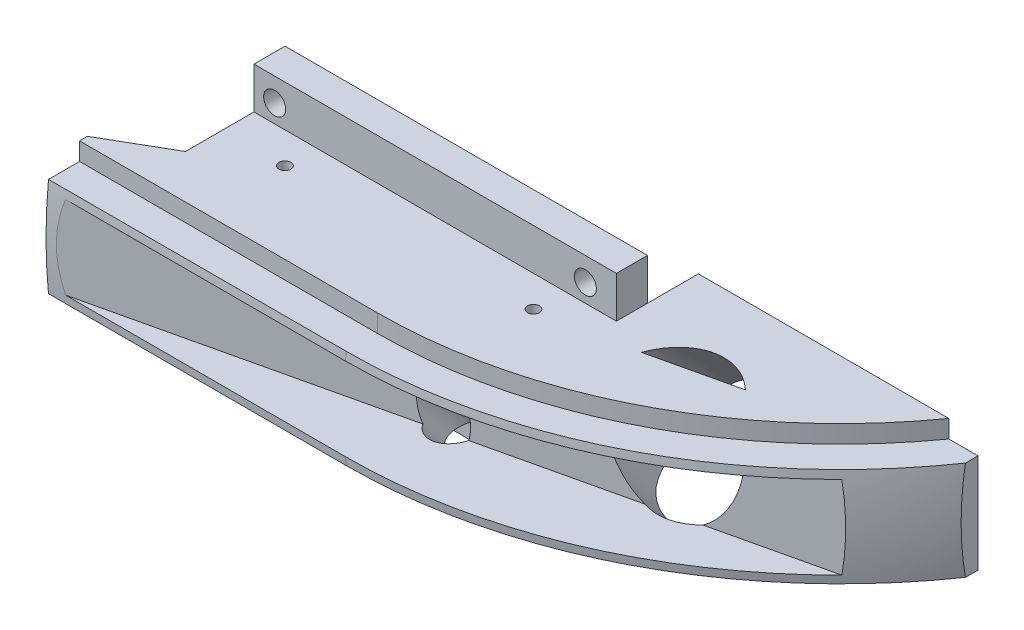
from build123d import *

# Parameters (mm, degrees)
EXTRUDE1_START             = 28.575
SKETCH1_W                  = 69.85
SKETCH1_H                  = 30.353
EXTRUDE1_DEPTH             = 215.9
EXTRUDE6_DEPTH             = 20.6375
SLOT_EXTRUDE7_DEPTH        = 12.7
SKETCH48_R                 = 18.25625
D_O_CUT_V3_DEPTH           = 259.471892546
EXTRUDE5_DEPTH             = 289.824673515
EXTRUDE5_DEPTH_BACK        = 289.824673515
F_6_CLEARANCE_DEPTH        = 289.824673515
F_6_CLEARANCE_DEPTH_BACK   = 289.824673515
SKETCH37_R                 = 1.8288
SKETCH42_W                 = 111.125
SKETCH42_H                 = 9.525
BOSS_EXTRUDE1_DEPTH        = 12.7
SKETCH43_W                 = 111.125
SKETCH43_H                 = 9.525
BOSS_EXTRUDE2_DEPTH        = 12.7
F_10_32_TAPPED_HOLE1_D     = 4.0386
F_10_32_TAPPED_HOLE1_DEPTH = 12.02944
F_10_32_TAPPED_HOLE1_TIP   = 1.213317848
F_1_4_CLEARANCE_HOLE1_D    = 6.7564
SKETCH40_R                 = 6.746875
EXTRUDE10_DEPTH            = 95.25
SKETCH41_R                 = 14.2875
EXTRUDE11_DEPTH            = 57.15


with BuildPart() as part:
    # Sketch1 → Extrude1 (new body)
    with BuildSketch(Plane(origin=(0, 0, 0), x_dir=(0, 0, -1), z_dir=(1, 0, 0)).offset(EXTRUDE1_START)):
        with Locations((-117.475, 0)):
            Rectangle(SKETCH1_W, SKETCH1_H)
    extrude(amount=EXTRUDE1_DEPTH)

    # Sketch3 → Cut-Revolve2 (revolve, cut)
    with BuildSketch(Plane(origin=(0, 0, 0), x_dir=(1, 0, 0), z_dir=(0, 1, 0))):
        with BuildLine():
            Line((-45.24375, -152.4), (119.85625, -152.4))
            ThreePointArc((119.85625, -152.4), (227.619323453, -107.763073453), (272.25625, 0))
            Line((272.25625, 0), (312.473048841, 0))
            Line((312.473048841, 0), (312.473048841, -174.012578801))
            Line((312.473048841, -174.012578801), (-45.24375, -156.399439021))
            Line((-45.24375, -156.399439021), (-45.24375, -152.4))
        make_face()
    revolve(axis=Axis((0, 0, 0), (1, 0, 0)), mode=Mode.SUBTRACT)

    # Sketch35 → Extrude6 (add, symmetric)
    with BuildSketch(Plane(origin=(0, 0, 0), x_dir=(1, 0, 0), z_dir=(0, 1, 0))):
        with BuildLine():
            Line((119.85625, -142.117453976), (28.575, -142.117453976))
            Line((28.575, -142.117453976), (28.575, -82.55))
            Line((28.575, -82.55), (235.540597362, -82.55))
            ThreePointArc((235.540597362, -82.55), (184.916125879, -126.351031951), (119.85625, -142.117453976))
        make_face()
    extrude(amount=EXTRUDE6_DEPTH, both=True)

    # Sketch36 → Slot Extrude7 (cut, symmetric)
    with BuildSketch(Plane(origin=(0, 0, 0), x_dir=(1, 0, 0), z_dir=(0, 1, 0))):
        Polygon((31.75, -152.4), (244.475, -103.288564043), (244.475, -152.4), align=None)
    extrude(amount=SLOT_EXTRUDE7_DEPTH, both=True, mode=Mode.SUBTRACT)

    # Sketch48 → D.O. Cut_V3 (cut, through all)
    with BuildSketch(Plane(origin=(18.933702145, 84.168096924, 82.010874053), x_dir=(0.9743700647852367, 0, -0.2249510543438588), z_dir=(0.15906441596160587, 0.7071067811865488, 0.6889836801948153))):
        with Locations(Location((154.551912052, -102.341151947, 0), (0, 0, 246.097393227))):
            Circle(SKETCH48_R)
    extrude(amount=-D_O_CUT_V3_DEPTH, mode=Mode.SUBTRACT)

    # Sketch32 → Extrude5 (cut, two sides: drawn at the far end of the back side and taken through both)
    with BuildSketch(Plane(origin=(0, 0, 0), x_dir=(1, 0, 0), z_dir=(0, 1, 0)).offset(-EXTRUDE5_DEPTH_BACK)):
        Polygon((47.625, -98.171), (47.625, -128.701477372), (28.575, -139.7), (28.575, -82.55), (158.75, -82.55), (158.75, -98.171), align=None)
    extrude(amount=EXTRUDE5_DEPTH + EXTRUDE5_DEPTH_BACK, mode=Mode.SUBTRACT)

    # Sketch37 → 6 CLEARANCE (cut, two sides: drawn at the far end of the back side and taken through both)
    with BuildSketch(Plane(origin=(0, 0, 0), x_dir=(1, 0, 0), z_dir=(0, 1, 0)).offset(-F_6_CLEARANCE_DEPTH_BACK)):
        with Locations(Location((142.875, -117.2337, 0), (0, 0, 270))):
            Circle(SKETCH37_R)
        with Locations(Location((66.675, -117.2337, 0), (0, 0, 270))):
            Circle(SKETCH37_R)
    extrude(amount=F_6_CLEARANCE_DEPTH + F_6_CLEARANCE_DEPTH_BACK, mode=Mode.SUBTRACT)

    # Sketch42 → Boss-Extrude1 (add)
    with BuildSketch(Plane.XZ.offset(20.6375)):
        with Locations((103.1875, 102.9335)):
            Rectangle(SKETCH42_W, SKETCH42_H)
    extrude(amount=BOSS_EXTRUDE1_DEPTH)

    # Sketch43 → Boss-Extrude2 (add)
    with BuildSketch(Plane(origin=(0, 20.6375, 0), x_dir=(1, 0, 0), z_dir=(0, 1, 0))):
        with Locations((103.1875, -102.9335)):
            Rectangle(SKETCH43_W, SKETCH43_H)
    extrude(amount=BOSS_EXTRUDE2_DEPTH)

    # 10-32 Tapped Hole1
    with Locations(Plane(origin=(47.413774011, -25.022900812, 98.171), x_dir=(-1, 0, 0), z_dir=(0, 0, -1))):
        with Locations((-6.561225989, 25.022900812), (-101.811225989, 25.022900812)):
            Hole(F_10_32_TAPPED_HOLE1_D / 2, depth=F_10_32_TAPPED_HOLE1_DEPTH)
            with Locations((0, 0, -(F_10_32_TAPPED_HOLE1_DEPTH + F_10_32_TAPPED_HOLE1_TIP / 2))):  # 118° drill point
                Cone(0, F_10_32_TAPPED_HOLE1_D / 2, F_10_32_TAPPED_HOLE1_TIP, mode=Mode.SUBTRACT)

    # 1_4 Clearance Hole1 (through all)
    with Locations(Plane(origin=(1.442542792, 26.073037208, 107.696), x_dir=(1, 0, 0), z_dir=(0, 0, 1))):
        with Locations((52.532457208, 0.120712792), (147.782457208, 0.120712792), (52.532457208, -52.266787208), (147.782457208, -52.266787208)):
            Hole(F_1_4_CLEARANCE_HOLE1_D / 2)

    # Sketch40 → Extrude10 (cut)
    with BuildSketch(Plane(origin=(0, 0, 0), x_dir=(-1, 0, 0), z_dir=(0, 0.7604059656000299, 0.6494480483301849))):
        with Locations(Location((-128.17475, 103.7209, 0), (0, 0, 270))):
            Circle(SKETCH40_R)
    extrude(amount=EXTRUDE10_DEPTH, mode=Mode.SUBTRACT)

    # Sketch41 → Extrude11 (cut)
    with BuildSketch(Plane(origin=(0, 0, 0), x_dir=(-1, 0, 0), z_dir=(0, 0.7604059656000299, 0.6494480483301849))):
        with Locations((-128.17475, 103.7209)):
            Circle(SKETCH41_R)
    extrude(amount=EXTRUDE11_DEPTH, mode=Mode.SUBTRACT)


solid = part.part
